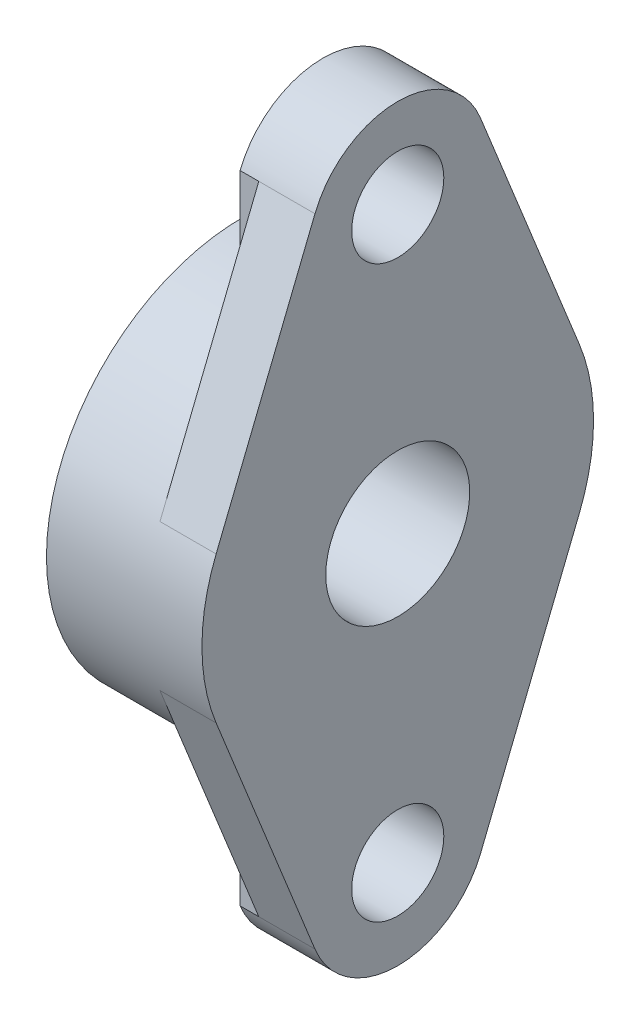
ISO-10303-21;
HEADER;
FILE_DESCRIPTION(('STEP AP214'),'2;1');
FILE_NAME('part.step','',(''),(''),'','','');
FILE_SCHEMA(('AUTOMOTIVE_DESIGN { 1 0 10303 214 1 1 1 1 }'));
ENDSEC;
DATA;
#1=APPLICATION_CONTEXT('core data for automotive mechanical design processes');
#2=APPLICATION_PROTOCOL_DEFINITION('international standard','automotive_design',2000,#1);
#3=PRODUCT_CONTEXT('',#1,'mechanical');
#4=PRODUCT('Part','Part','',(#3));
#5=PRODUCT_RELATED_PRODUCT_CATEGORY('part','',(#4));
#6=PRODUCT_DEFINITION_FORMATION('','',#4);
#7=PRODUCT_DEFINITION_CONTEXT('part definition',#1,'design');
#8=PRODUCT_DEFINITION('design','',#6,#7);
#9=PRODUCT_DEFINITION_SHAPE('','',#8);
#10=(LENGTH_UNIT() NAMED_UNIT(*) SI_UNIT(.MILLI.,.METRE.));
#11=(NAMED_UNIT(*) PLANE_ANGLE_UNIT() SI_UNIT($,.RADIAN.));
#12=(NAMED_UNIT(*) SI_UNIT($,.STERADIAN.) SOLID_ANGLE_UNIT());
#13=UNCERTAINTY_MEASURE_WITH_UNIT(LENGTH_MEASURE(1.E-05),#10,'distance_accuracy_value','');
#14=(GEOMETRIC_REPRESENTATION_CONTEXT(3) GLOBAL_UNCERTAINTY_ASSIGNED_CONTEXT((#13)) GLOBAL_UNIT_ASSIGNED_CONTEXT((#10,
#11,#12)) REPRESENTATION_CONTEXT('',''));
#15=CARTESIAN_POINT('',(0.,0.,0.));
#16=DIRECTION('',(0.,0.,1.));
#17=DIRECTION('',(1.,0.,0.));
#18=AXIS2_PLACEMENT_3D('',#15,#16,#17);
#19=CARTESIAN_POINT('',(-9.75,-55.5484247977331,-31.536175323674));
#20=DIRECTION('',(-1.,0.,0.));
#21=DIRECTION('',(0.,0.,1.));
#22=AXIS2_PLACEMENT_3D('',#19,#20,#21);
#23=PLANE('',#22);
#24=DIRECTION('',(0.,-1.,0.));
#25=VECTOR('',#24,1.);
#26=CARTESIAN_POINT('',(-9.75,-43.0518860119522,-14.376785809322));
#27=LINE('',#26,#25);
#28=CARTESIAN_POINT('',(-9.75,-30.810842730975,-14.376785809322));
#29=VERTEX_POINT('',#28);
#30=CARTESIAN_POINT('',(-9.75,-55.2929292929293,-14.376785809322));
#31=VERTEX_POINT('',#30);
#32=EDGE_CURVE('E71',#29,#31,#27,.T.);
#33=ORIENTED_EDGE('',*,*,#32,.F.);
#34=CARTESIAN_POINT('',(-9.75,0.,0.));
#35=DIRECTION('',(-1.,0.,0.));
#36=DIRECTION('',(0.,0.,1.));
#37=AXIS2_PLACEMENT_3D('',#34,#35,#36);
#38=CIRCLE('',#37,34.);
#39=CARTESIAN_POINT('',(-9.75,-12.7103451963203,-31.534855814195));
#40=VERTEX_POINT('',#39);
#41=EDGE_CURVE('E208',#40,#29,#38,.T.);
#42=ORIENTED_EDGE('',*,*,#41,.F.);
#43=DIRECTION('',(0.,0.927534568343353,-0.373737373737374));
#44=VECTOR('',#43,1.);
#45=CARTESIAN_POINT('',(-9.75,-34.,-22.956480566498));
#46=LINE('',#45,#44);
#47=EDGE_CURVE('E308',#31,#40,#46,.T.);
#48=ORIENTED_EDGE('',*,*,#47,.F.);
#49=EDGE_LOOP('',(#33,#42,#48));
#50=FACE_BOUND('',#49,.T.);
#51=ADVANCED_FACE('F16',(#50),#23,.T.);
#52=CARTESIAN_POINT('',(-13.,-55.2929292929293,-14.376785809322));
#53=DIRECTION('',(0.,0.,-1.));
#54=DIRECTION('',(0.,1.,0.));
#55=AXIS2_PLACEMENT_3D('',#52,#53,#54);
#56=PLANE('',#55);
#57=DIRECTION('',(0.,-1.,0.));
#58=VECTOR('',#57,1.);
#59=CARTESIAN_POINT('',(-13.,-48.0763671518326,-14.376785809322));
#60=LINE('',#59,#58);
#61=CARTESIAN_POINT('',(-13.,-30.8108427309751,-14.376785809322));
#62=VERTEX_POINT('',#61);
#63=CARTESIAN_POINT('',(-13.,-55.2929292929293,-14.376785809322));
#64=VERTEX_POINT('',#63);
#65=EDGE_CURVE('E65',#62,#64,#60,.T.);
#66=ORIENTED_EDGE('',*,*,#65,.F.);
#67=DIRECTION('',(-1.,0.,0.));
#68=VECTOR('',#67,1.);
#69=CARTESIAN_POINT('',(-13.5,-30.810842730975,-14.376785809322));
#70=LINE('',#69,#68);
#71=EDGE_CURVE('E300',#29,#62,#70,.T.);
#72=ORIENTED_EDGE('',*,*,#71,.F.);
#73=ORIENTED_EDGE('',*,*,#32,.T.);
#74=DIRECTION('',(1.,0.,0.));
#75=VECTOR('',#74,1.);
#76=CARTESIAN_POINT('',(-6.5,-55.2929292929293,-14.376785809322));
#77=LINE('',#76,#75);
#78=EDGE_CURVE('E316',#64,#31,#77,.T.);
#79=ORIENTED_EDGE('',*,*,#78,.F.);
#80=EDGE_LOOP('',(#66,#72,#73,#79));
#81=FACE_BOUND('',#80,.T.);
#82=ADVANCED_FACE('F482',(#81),#56,.T.);
#83=CARTESIAN_POINT('',(-9.75,12.454849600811,-31.536175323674));
#84=DIRECTION('',(-1.,0.,0.));
#85=DIRECTION('',(0.,0.,1.));
#86=AXIS2_PLACEMENT_3D('',#83,#84,#85);
#87=PLANE('',#86);
#88=CARTESIAN_POINT('',(-9.75,0.,0.));
#89=DIRECTION('',(-1.,0.,0.));
#90=DIRECTION('',(0.,0.,1.));
#91=AXIS2_PLACEMENT_3D('',#88,#89,#90);
#92=CIRCLE('',#91,34.);
#93=CARTESIAN_POINT('',(-9.75,30.8108427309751,-14.376785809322));
#94=VERTEX_POINT('',#93);
#95=CARTESIAN_POINT('',(-9.75,12.7103451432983,-31.5348558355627));
#96=VERTEX_POINT('',#95);
#97=EDGE_CURVE('E360',#94,#96,#92,.T.);
#98=ORIENTED_EDGE('',*,*,#97,.F.);
#99=DIRECTION('',(0.,-1.,0.));
#100=VECTOR('',#99,1.);
#101=CARTESIAN_POINT('',(-9.75,43.0518860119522,-14.376785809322));
#102=LINE('',#101,#100);
#103=CARTESIAN_POINT('',(-9.75,55.2929292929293,-14.376785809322));
#104=VERTEX_POINT('',#103);
#105=EDGE_CURVE('E270',#104,#94,#102,.T.);
#106=ORIENTED_EDGE('',*,*,#105,.F.);
#107=DIRECTION('',(0.,0.927534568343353,0.373737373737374));
#108=VECTOR('',#107,1.);
#109=CARTESIAN_POINT('',(-9.75,34.,-22.956480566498));
#110=LINE('',#109,#108);
#111=EDGE_CURVE('E203',#96,#104,#110,.T.);
#112=ORIENTED_EDGE('',*,*,#111,.F.);
#113=EDGE_LOOP('',(#98,#106,#112));
#114=FACE_BOUND('',#113,.T.);
#115=ADVANCED_FACE('F371',(#114),#87,.T.);
#116=CARTESIAN_POINT('',(-13.,30.810842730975,-14.376785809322));
#117=DIRECTION('',(0.,0.,-1.));
#118=DIRECTION('',(0.,1.,0.));
#119=AXIS2_PLACEMENT_3D('',#116,#117,#118);
#120=PLANE('',#119);
#121=DIRECTION('',(0.,-1.,0.));
#122=VECTOR('',#121,1.);
#123=CARTESIAN_POINT('',(-13.,48.0763671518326,-14.376785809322));
#124=LINE('',#123,#122);
#125=CARTESIAN_POINT('',(-13.,55.2929292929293,-14.376785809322));
#126=VERTEX_POINT('',#125);
#127=CARTESIAN_POINT('',(-13.,30.8108427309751,-14.376785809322));
#128=VERTEX_POINT('',#127);
#129=EDGE_CURVE('E245',#126,#128,#124,.T.);
#130=ORIENTED_EDGE('',*,*,#129,.F.);
#131=DIRECTION('',(-1.,0.,0.));
#132=VECTOR('',#131,1.);
#133=CARTESIAN_POINT('',(-6.5,55.2929292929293,-14.376785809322));
#134=LINE('',#133,#132);
#135=EDGE_CURVE('E197',#104,#126,#134,.T.);
#136=ORIENTED_EDGE('',*,*,#135,.F.);
#137=ORIENTED_EDGE('',*,*,#105,.T.);
#138=DIRECTION('',(1.,0.,0.));
#139=VECTOR('',#138,1.);
#140=CARTESIAN_POINT('',(-13.5,30.8108427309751,-14.376785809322));
#141=LINE('',#140,#139);
#142=EDGE_CURVE('E215',#128,#94,#141,.T.);
#143=ORIENTED_EDGE('',*,*,#142,.F.);
#144=EDGE_LOOP('',(#130,#136,#137,#143));
#145=FACE_BOUND('',#144,.T.);
#146=ADVANCED_FACE('F366',(#145),#120,.T.);
#147=CARTESIAN_POINT('',(-13.,-30.810842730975,14.376785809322));
#148=DIRECTION('',(0.,0.,1.));
#149=DIRECTION('',(0.,-1.,0.));
#150=AXIS2_PLACEMENT_3D('',#147,#148,#149);
#151=PLANE('',#150);
#152=DIRECTION('',(0.,1.,0.));
#153=VECTOR('',#152,1.);
#154=CARTESIAN_POINT('',(-13.,-48.0763671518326,14.376785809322));
#155=LINE('',#154,#153);
#156=CARTESIAN_POINT('',(-13.,-55.2929292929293,14.376785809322));
#157=VERTEX_POINT('',#156);
#158=CARTESIAN_POINT('',(-13.,-30.8108427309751,14.376785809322));
#159=VERTEX_POINT('',#158);
#160=EDGE_CURVE('E59',#157,#159,#155,.T.);
#161=ORIENTED_EDGE('',*,*,#160,.F.);
#162=DIRECTION('',(-1.,0.,0.));
#163=VECTOR('',#162,1.);
#164=CARTESIAN_POINT('',(-6.5,-55.2929292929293,14.376785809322));
#165=LINE('',#164,#163);
#166=CARTESIAN_POINT('',(-9.75,-55.2929292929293,14.376785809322));
#167=VERTEX_POINT('',#166);
#168=EDGE_CURVE('E257',#167,#157,#165,.T.);
#169=ORIENTED_EDGE('',*,*,#168,.F.);
#170=DIRECTION('',(0.,1.,0.));
#171=VECTOR('',#170,1.);
#172=CARTESIAN_POINT('',(-9.75,-55.2929292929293,14.376785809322));
#173=LINE('',#172,#171);
#174=CARTESIAN_POINT('',(-9.75,-30.8108427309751,14.376785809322));
#175=VERTEX_POINT('',#174);
#176=EDGE_CURVE('E251',#175,#167,#173,.F.);
#177=ORIENTED_EDGE('',*,*,#176,.F.);
#178=DIRECTION('',(1.,0.,0.));
#179=VECTOR('',#178,1.);
#180=CARTESIAN_POINT('',(-13.5,-30.8108427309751,14.376785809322));
#181=LINE('',#180,#179);
#182=EDGE_CURVE('E277',#159,#175,#181,.T.);
#183=ORIENTED_EDGE('',*,*,#182,.F.);
#184=EDGE_LOOP('',(#161,#169,#177,#183));
#185=FACE_BOUND('',#184,.T.);
#186=ADVANCED_FACE('F432',(#185),#151,.T.);
#187=CARTESIAN_POINT('',(-9.75,12.45484965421,14.376785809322));
#188=DIRECTION('',(-1.,0.,0.));
#189=DIRECTION('',(0.,0.,1.));
#190=AXIS2_PLACEMENT_3D('',#187,#188,#189);
#191=PLANE('',#190);
#192=DIRECTION('',(0.,1.,0.));
#193=VECTOR('',#192,1.);
#194=CARTESIAN_POINT('',(-9.75,43.0518860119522,14.376785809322));
#195=LINE('',#194,#193);
#196=CARTESIAN_POINT('',(-9.75,30.8108427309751,14.376785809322));
#197=VERTEX_POINT('',#196);
#198=CARTESIAN_POINT('',(-9.75,55.2929292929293,14.376785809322));
#199=VERTEX_POINT('',#198);
#200=EDGE_CURVE('E133',#197,#199,#195,.T.);
#201=ORIENTED_EDGE('',*,*,#200,.F.);
#202=CARTESIAN_POINT('',(-9.75,0.,0.));
#203=DIRECTION('',(-1.,0.,0.));
#204=DIRECTION('',(0.,0.,1.));
#205=AXIS2_PLACEMENT_3D('',#202,#203,#204);
#206=CIRCLE('',#205,34.);
#207=CARTESIAN_POINT('',(-9.75,12.710345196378,31.5348558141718));
#208=VERTEX_POINT('',#207);
#209=EDGE_CURVE('E184',#208,#197,#206,.T.);
#210=ORIENTED_EDGE('',*,*,#209,.F.);
#211=DIRECTION('',(0.,-0.927534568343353,0.373737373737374));
#212=VECTOR('',#211,1.);
#213=CARTESIAN_POINT('',(-9.75,34.,22.956480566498));
#214=LINE('',#213,#212);
#215=EDGE_CURVE('E274',#199,#208,#214,.T.);
#216=ORIENTED_EDGE('',*,*,#215,.F.);
#217=EDGE_LOOP('',(#201,#210,#216));
#218=FACE_BOUND('',#217,.T.);
#219=ADVANCED_FACE('F420',(#218),#191,.T.);
#220=CARTESIAN_POINT('',(-13.,55.2929292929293,14.376785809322));
#221=DIRECTION('',(0.,0.,1.));
#222=DIRECTION('',(0.,-1.,0.));
#223=AXIS2_PLACEMENT_3D('',#220,#221,#222);
#224=PLANE('',#223);
#225=DIRECTION('',(0.,1.,0.));
#226=VECTOR('',#225,1.);
#227=CARTESIAN_POINT('',(-13.,48.0763671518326,14.376785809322));
#228=LINE('',#227,#226);
#229=CARTESIAN_POINT('',(-13.,30.8108427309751,14.376785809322));
#230=VERTEX_POINT('',#229);
#231=CARTESIAN_POINT('',(-13.,55.2929292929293,14.376785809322));
#232=VERTEX_POINT('',#231);
#233=EDGE_CURVE('E128',#230,#232,#228,.T.);
#234=ORIENTED_EDGE('',*,*,#233,.F.);
#235=DIRECTION('',(-1.,0.,0.));
#236=VECTOR('',#235,1.);
#237=CARTESIAN_POINT('',(-13.5,30.8108427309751,14.376785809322));
#238=LINE('',#237,#236);
#239=EDGE_CURVE('E267',#197,#230,#238,.T.);
#240=ORIENTED_EDGE('',*,*,#239,.F.);
#241=ORIENTED_EDGE('',*,*,#200,.T.);
#242=DIRECTION('',(1.,0.,0.));
#243=VECTOR('',#242,1.);
#244=CARTESIAN_POINT('',(-6.5,55.2929292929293,14.376785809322));
#245=LINE('',#244,#243);
#246=EDGE_CURVE('E284',#232,#199,#245,.T.);
#247=ORIENTED_EDGE('',*,*,#246,.F.);
#248=EDGE_LOOP('',(#234,#240,#241,#247));
#249=FACE_BOUND('',#248,.T.);
#250=ADVANCED_FACE('F424',(#249),#224,.T.);
#251=CARTESIAN_POINT('',(-9.75,-55.5484247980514,14.376785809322));
#252=DIRECTION('',(-1.,0.,0.));
#253=DIRECTION('',(0.,0.,1.));
#254=AXIS2_PLACEMENT_3D('',#251,#252,#253);
#255=PLANE('',#254);
#256=CARTESIAN_POINT('',(-9.75,0.,0.));
#257=DIRECTION('',(-1.,0.,0.));
#258=DIRECTION('',(0.,0.,1.));
#259=AXIS2_PLACEMENT_3D('',#256,#257,#258);
#260=CIRCLE('',#259,34.);
#261=CARTESIAN_POINT('',(-9.75,-12.7103451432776,31.5348558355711));
#262=VERTEX_POINT('',#261);
#263=EDGE_CURVE('E154',#175,#262,#260,.T.);
#264=ORIENTED_EDGE('',*,*,#263,.F.);
#265=ORIENTED_EDGE('',*,*,#176,.T.);
#266=DIRECTION('',(0.,-0.927534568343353,-0.373737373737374));
#267=VECTOR('',#266,1.);
#268=CARTESIAN_POINT('',(-9.75,-34.,22.956480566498));
#269=LINE('',#268,#267);
#270=EDGE_CURVE('E171',#262,#167,#269,.T.);
#271=ORIENTED_EDGE('',*,*,#270,.F.);
#272=EDGE_LOOP('',(#264,#265,#271));
#273=FACE_BOUND('',#272,.T.);
#274=ADVANCED_FACE('F238',(#273),#255,.T.);
#275=CARTESIAN_POINT('',(-13.,30.810842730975,14.376785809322));
#276=CARTESIAN_POINT('',(-13.,65.,14.376785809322));
#277=CARTESIAN_POINT('',(-13.,65.3418915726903,14.376785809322));
#278=B_SPLINE_CURVE_WITH_KNOTS('',1,(#275,#276,#277),.UNSPECIFIED.,.F.,.F.,(2,1,2),(0.,1.,1.01),.UNSPECIFIED.);
#279=DIRECTION('',(0.,0.,-1.));
#280=VECTOR('',#279,1.);
#281=SURFACE_OF_LINEAR_EXTRUSION('',#278,#280);
#282=CARTESIAN_POINT('',(-13.,49.5,0.));
#283=DIRECTION('',(1.,0.,0.));
#284=DIRECTION('',(0.,0.,-1.));
#285=AXIS2_PLACEMENT_3D('',#282,#283,#284);
#286=CIRCLE('',#285,8.);
#287=CARTESIAN_POINT('',(-13.,49.5,-8.));
#288=VERTEX_POINT('',#287);
#289=EDGE_CURVE('E165',#288,#288,#286,.F.);
#290=ORIENTED_EDGE('',*,*,#289,.F.);
#291=EDGE_LOOP('',(#290));
#292=FACE_BOUND('',#291,.T.);
#293=ORIENTED_EDGE('',*,*,#129,.T.);
#294=CARTESIAN_POINT('',(-13.,0.,0.));
#295=DIRECTION('',(-1.,0.,0.));
#296=DIRECTION('',(0.,0.,1.));
#297=AXIS2_PLACEMENT_3D('',#294,#295,#296);
#298=CIRCLE('',#297,34.);
#299=EDGE_CURVE('E261',#230,#128,#298,.T.);
#300=ORIENTED_EDGE('',*,*,#299,.F.);
#301=ORIENTED_EDGE('',*,*,#233,.T.);
#302=CARTESIAN_POINT('',(-13.,49.5,0.));
#303=DIRECTION('',(1.,0.,0.));
#304=DIRECTION('',(0.,0.,-1.));
#305=AXIS2_PLACEMENT_3D('',#302,#303,#304);
#306=CIRCLE('',#305,15.5);
#307=EDGE_CURVE('E288',#126,#232,#306,.T.);
#308=ORIENTED_EDGE('',*,*,#307,.F.);
#309=EDGE_LOOP('',(#293,#300,#301,#308));
#310=FACE_BOUND('',#309,.T.);
#311=ADVANCED_FACE('F232',(#292,#310),#281,.T.);
#312=CARTESIAN_POINT('',(-13.,-65.3418915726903,14.376785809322));
#313=CARTESIAN_POINT('',(-13.,-65.,14.376785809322));
#314=CARTESIAN_POINT('',(-13.,-30.810842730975,14.376785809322));
#315=B_SPLINE_CURVE_WITH_KNOTS('',1,(#312,#313,#314),.UNSPECIFIED.,.F.,.F.,(2,1,2),(-0.01,0.,
1.),.UNSPECIFIED.);
#316=DIRECTION('',(0.,0.,-1.));
#317=VECTOR('',#316,1.);
#318=SURFACE_OF_LINEAR_EXTRUSION('',#315,#317);
#319=CARTESIAN_POINT('',(-13.,-49.5,0.));
#320=DIRECTION('',(1.,0.,0.));
#321=DIRECTION('',(0.,0.,-1.));
#322=AXIS2_PLACEMENT_3D('',#319,#320,#321);
#323=CIRCLE('',#322,8.);
#324=CARTESIAN_POINT('',(-13.,-49.5,-8.));
#325=VERTEX_POINT('',#324);
#326=EDGE_CURVE('E169',#325,#325,#323,.F.);
#327=ORIENTED_EDGE('',*,*,#326,.F.);
#328=EDGE_LOOP('',(#327));
#329=FACE_BOUND('',#328,.T.);
#330=ORIENTED_EDGE('',*,*,#65,.T.);
#331=CARTESIAN_POINT('',(-13.,-49.5,0.));
#332=DIRECTION('',(1.,0.,0.));
#333=DIRECTION('',(0.,0.,-1.));
#334=AXIS2_PLACEMENT_3D('',#331,#332,#333);
#335=CIRCLE('',#334,15.5);
#336=EDGE_CURVE('E19',#157,#64,#335,.T.);
#337=ORIENTED_EDGE('',*,*,#336,.F.);
#338=ORIENTED_EDGE('',*,*,#160,.T.);
#339=CARTESIAN_POINT('',(-13.,0.,0.));
#340=DIRECTION('',(-1.,0.,0.));
#341=DIRECTION('',(0.,0.,1.));
#342=AXIS2_PLACEMENT_3D('',#339,#340,#341);
#343=CIRCLE('',#342,34.);
#344=EDGE_CURVE('E353',#62,#159,#343,.T.);
#345=ORIENTED_EDGE('',*,*,#344,.F.);
#346=EDGE_LOOP('',(#330,#337,#338,#345));
#347=FACE_BOUND('',#346,.T.);
#348=ADVANCED_FACE('F227',(#329,#347),#318,.T.);
#349=CARTESIAN_POINT('',(-27.,-34.,34.4080021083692));
#350=DIRECTION('',(-1.,0.,0.));
#351=DIRECTION('',(0.,1.,0.));
#352=AXIS2_PLACEMENT_3D('',#349,#350,#351);
#353=PLANE('',#352);
#354=CARTESIAN_POINT('',(-27.,0.,0.));
#355=DIRECTION('',(-1.,0.,0.));
#356=DIRECTION('',(0.,0.,1.));
#357=AXIS2_PLACEMENT_3D('',#354,#355,#356);
#358=CIRCLE('',#357,18.75);
#359=CARTESIAN_POINT('',(-27.,0.,18.75));
#360=VERTEX_POINT('',#359);
#361=EDGE_CURVE('E344',#360,#360,#358,.T.);
#362=ORIENTED_EDGE('',*,*,#361,.F.);
#363=EDGE_LOOP('',(#362));
#364=FACE_BOUND('',#363,.T.);
#365=CARTESIAN_POINT('',(-27.,0.,0.));
#366=DIRECTION('',(-1.,0.,0.));
#367=DIRECTION('',(0.,0.,1.));
#368=AXIS2_PLACEMENT_3D('',#365,#366,#367);
#369=CIRCLE('',#368,34.);
#370=CARTESIAN_POINT('',(-27.,0.,34.));
#371=VERTEX_POINT('',#370);
#372=EDGE_CURVE('E190',#371,#371,#369,.F.);
#373=ORIENTED_EDGE('',*,*,#372,.F.);
#374=EDGE_LOOP('',(#373));
#375=FACE_BOUND('',#374,.T.);
#376=ADVANCED_FACE('F231',(#364,#375),#353,.T.);
#377=CARTESIAN_POINT('',(0.,-49.5,0.));
#378=DIRECTION('',(1.,0.,0.));
#379=DIRECTION('',(0.,0.,-1.));
#380=AXIS2_PLACEMENT_3D('',#377,#378,#379);
#381=CYLINDRICAL_SURFACE('',#380,15.5);
#382=ORIENTED_EDGE('',*,*,#336,.T.);
#383=ORIENTED_EDGE('',*,*,#78,.T.);
#384=DIRECTION('',(1.,0.,0.));
#385=VECTOR('',#384,1.);
#386=CARTESIAN_POINT('',(-9.75,-55.2929292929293,-14.376785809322));
#387=LINE('',#386,#385);
#388=CARTESIAN_POINT('',(0.,-55.2929292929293,-14.376785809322));
#389=VERTEX_POINT('',#388);
#390=EDGE_CURVE('E212',#389,#31,#387,.F.);
#391=ORIENTED_EDGE('',*,*,#390,.F.);
#392=CARTESIAN_POINT('',(0.,-49.5,0.));
#393=DIRECTION('',(1.,0.,0.));
#394=DIRECTION('',(0.,0.,-1.));
#395=AXIS2_PLACEMENT_3D('',#392,#393,#394);
#396=CIRCLE('',#395,15.5);
#397=CARTESIAN_POINT('',(0.,-55.2929292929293,14.376785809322));
#398=VERTEX_POINT('',#397);
#399=EDGE_CURVE('E341',#398,#389,#396,.T.);
#400=ORIENTED_EDGE('',*,*,#399,.F.);
#401=DIRECTION('',(1.,0.,0.));
#402=VECTOR('',#401,1.);
#403=CARTESIAN_POINT('',(-9.75,-55.2929292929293,14.376785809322));
#404=LINE('',#403,#402);
#405=EDGE_CURVE('E166',#167,#398,#404,.T.);
#406=ORIENTED_EDGE('',*,*,#405,.F.);
#407=ORIENTED_EDGE('',*,*,#168,.T.);
#408=EDGE_LOOP('',(#382,#383,#391,#400,#406,#407));
#409=FACE_BOUND('',#408,.T.);
#410=ADVANCED_FACE('F454',(#409),#381,.T.);
#411=CARTESIAN_POINT('',(-9.75,-55.2929292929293,-14.376785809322));
#412=DIRECTION('',(0.,-0.373737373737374,-0.927534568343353));
#413=DIRECTION('',(0.,0.927534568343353,-0.373737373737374));
#414=AXIS2_PLACEMENT_3D('',#411,#412,#413);
#415=PLANE('',#414);
#416=CARTESIAN_POINT('',(0.,-55.2929292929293,-14.376785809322));
#417=CARTESIAN_POINT('',(0.,-53.5185185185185,-15.09176037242));
#418=CARTESIAN_POINT('',(0.,-51.7441077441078,-15.806734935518));
#419=CARTESIAN_POINT('',(0.,-48.1952861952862,-17.236684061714));
#420=CARTESIAN_POINT('',(0.,-46.4208754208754,-17.951658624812));
#421=CARTESIAN_POINT('',(0.,-42.8720538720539,-19.381607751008));
#422=CARTESIAN_POINT('',(0.,-41.0976430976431,-20.096582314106));
#423=CARTESIAN_POINT('',(0.,-37.5488215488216,-21.526531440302));
#424=CARTESIAN_POINT('',(0.,-35.7744107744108,-22.2415060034));
#425=CARTESIAN_POINT('',(0.,-32.2255892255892,-23.671455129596));
#426=CARTESIAN_POINT('',(0.,-30.4511784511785,-24.386429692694));
#427=CARTESIAN_POINT('',(0.,-26.9023569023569,-25.81637881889));
#428=CARTESIAN_POINT('',(0.,-25.1279461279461,-26.531353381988));
#429=CARTESIAN_POINT('',(0.,-21.5791245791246,-27.961302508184));
#430=CARTESIAN_POINT('',(0.,-19.8047138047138,-28.676277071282));
#431=CARTESIAN_POINT('',(0.,-16.2558922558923,-30.106226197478));
#432=CARTESIAN_POINT('',(0.,-14.4814814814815,-30.821200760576));
#433=CARTESIAN_POINT('',(0.,-12.7070707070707,-31.536175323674));
#434=B_SPLINE_CURVE_WITH_KNOTS('',3,(#416,#417,#418,#419,#420,#421,#422,#423,#424,#425,#426,
#427,#428,#429,#430,#431,#432,#433),.UNSPECIFIED.,.F.,.F.,(4,2,2,2,2,2,2,2,4),(0.,
5.7391201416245,11.478240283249,17.2173604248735,22.956480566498,28.6956007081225,
34.434720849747,40.1738409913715,45.912961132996),.UNSPECIFIED.);
#435=CARTESIAN_POINT('',(0.,-12.7070707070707,-31.536175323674));
#436=VERTEX_POINT('',#435);
#437=EDGE_CURVE('E340',#389,#436,#434,.T.);
#438=ORIENTED_EDGE('',*,*,#437,.F.);
#439=ORIENTED_EDGE('',*,*,#390,.T.);
#440=ORIENTED_EDGE('',*,*,#47,.T.);
#441=CARTESIAN_POINT('',(-9.75,-12.7070707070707,-31.536175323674));
#442=VERTEX_POINT('',#441);
#443=EDGE_CURVE('E34',#40,#442,#46,.T.);
#444=ORIENTED_EDGE('',*,*,#443,.T.);
#445=DIRECTION('',(-1.,0.,0.));
#446=VECTOR('',#445,1.);
#447=CARTESIAN_POINT('',(-13.5,-12.7070707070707,-31.536175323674));
#448=LINE('',#447,#446);
#449=EDGE_CURVE('E206',#436,#442,#448,.T.);
#450=ORIENTED_EDGE('',*,*,#449,.F.);
#451=EDGE_LOOP('',(#438,#439,#440,#444,#450));
#452=FACE_BOUND('',#451,.T.);
#453=ADVANCED_FACE('F472',(#452),#415,.T.);
#454=CARTESIAN_POINT('',(-9.75,12.7070707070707,-31.536175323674));
#455=DIRECTION('',(0.,0.373737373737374,-0.927534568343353));
#456=DIRECTION('',(0.,0.927534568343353,0.373737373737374));
#457=AXIS2_PLACEMENT_3D('',#454,#455,#456);
#458=PLANE('',#457);
#459=CARTESIAN_POINT('',(0.,12.7070707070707,-31.536175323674));
#460=CARTESIAN_POINT('',(0.,14.4814814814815,-30.821200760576));
#461=CARTESIAN_POINT('',(0.,16.2558922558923,-30.106226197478));
#462=CARTESIAN_POINT('',(0.,19.8047138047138,-28.676277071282));
#463=CARTESIAN_POINT('',(0.,21.5791245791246,-27.961302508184));
#464=CARTESIAN_POINT('',(0.,25.1279461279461,-26.531353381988));
#465=CARTESIAN_POINT('',(0.,26.9023569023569,-25.81637881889));
#466=CARTESIAN_POINT('',(0.,30.4511784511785,-24.386429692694));
#467=CARTESIAN_POINT('',(0.,32.2255892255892,-23.671455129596));
#468=CARTESIAN_POINT('',(0.,35.7744107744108,-22.2415060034));
#469=CARTESIAN_POINT('',(0.,37.5488215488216,-21.526531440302));
#470=CARTESIAN_POINT('',(0.,41.0976430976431,-20.096582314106));
#471=CARTESIAN_POINT('',(0.,42.8720538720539,-19.381607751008));
#472=CARTESIAN_POINT('',(0.,46.4208754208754,-17.951658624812));
#473=CARTESIAN_POINT('',(0.,48.1952861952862,-17.236684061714));
#474=CARTESIAN_POINT('',(0.,51.7441077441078,-15.806734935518));
#475=CARTESIAN_POINT('',(0.,53.5185185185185,-15.09176037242));
#476=CARTESIAN_POINT('',(0.,55.2929292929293,-14.376785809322));
#477=B_SPLINE_CURVE_WITH_KNOTS('',3,(#459,#460,#461,#462,#463,#464,#465,#466,#467,#468,#469,
#470,#471,#472,#473,#474,#475,#476),.UNSPECIFIED.,.F.,.F.,(4,2,2,2,2,2,2,2,4),(0.,
5.7391201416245,11.478240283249,17.2173604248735,22.956480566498,28.6956007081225,
34.434720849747,40.1738409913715,45.912961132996),.UNSPECIFIED.);
#478=CARTESIAN_POINT('',(0.,12.7070707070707,-31.536175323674));
#479=VERTEX_POINT('',#478);
#480=CARTESIAN_POINT('',(0.,55.2929292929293,-14.376785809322));
#481=VERTEX_POINT('',#480);
#482=EDGE_CURVE('E336',#479,#481,#477,.T.);
#483=ORIENTED_EDGE('',*,*,#482,.F.);
#484=DIRECTION('',(1.,0.,0.));
#485=VECTOR('',#484,1.);
#486=CARTESIAN_POINT('',(-9.75,12.7070707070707,-31.536175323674));
#487=LINE('',#486,#485);
#488=CARTESIAN_POINT('',(-9.75,12.7070707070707,-31.536175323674));
#489=VERTEX_POINT('',#488);
#490=EDGE_CURVE('E198',#479,#489,#487,.F.);
#491=ORIENTED_EDGE('',*,*,#490,.T.);
#492=CARTESIAN_POINT('',(-9.75,0.,0.));
#493=DIRECTION('',(-1.,0.,0.));
#494=DIRECTION('',(0.,1.,0.));
#495=AXIS2_PLACEMENT_3D('',#492,#493,#494);
#496=CIRCLE('',#495,34.);
#497=EDGE_CURVE('E209',#96,#489,#496,.T.);
#498=ORIENTED_EDGE('',*,*,#497,.F.);
#499=ORIENTED_EDGE('',*,*,#111,.T.);
#500=DIRECTION('',(-1.,0.,0.));
#501=VECTOR('',#500,1.);
#502=CARTESIAN_POINT('',(-6.5,55.2929292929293,-14.376785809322));
#503=LINE('',#502,#501);
#504=EDGE_CURVE('E194',#481,#104,#503,.T.);
#505=ORIENTED_EDGE('',*,*,#504,.F.);
#506=EDGE_LOOP('',(#483,#491,#498,#499,#505));
#507=FACE_BOUND('',#506,.T.);
#508=ADVANCED_FACE('F374',(#507),#458,.T.);
#509=CARTESIAN_POINT('',(0.,49.5,0.));
#510=DIRECTION('',(1.,0.,0.));
#511=DIRECTION('',(0.,0.,-1.));
#512=AXIS2_PLACEMENT_3D('',#509,#510,#511);
#513=CYLINDRICAL_SURFACE('',#512,15.5);
#514=ORIENTED_EDGE('',*,*,#307,.T.);
#515=ORIENTED_EDGE('',*,*,#246,.T.);
#516=DIRECTION('',(1.,0.,0.));
#517=VECTOR('',#516,1.);
#518=CARTESIAN_POINT('',(-9.75,55.2929292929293,14.376785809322));
#519=LINE('',#518,#517);
#520=CARTESIAN_POINT('',(0.,55.2929292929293,14.376785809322));
#521=VERTEX_POINT('',#520);
#522=EDGE_CURVE('E187',#521,#199,#519,.F.);
#523=ORIENTED_EDGE('',*,*,#522,.F.);
#524=CARTESIAN_POINT('',(0.,49.5,0.));
#525=DIRECTION('',(1.,0.,0.));
#526=DIRECTION('',(0.,0.,-1.));
#527=AXIS2_PLACEMENT_3D('',#524,#525,#526);
#528=CIRCLE('',#527,15.5);
#529=EDGE_CURVE('E333',#481,#521,#528,.T.);
#530=ORIENTED_EDGE('',*,*,#529,.F.);
#531=ORIENTED_EDGE('',*,*,#504,.T.);
#532=ORIENTED_EDGE('',*,*,#135,.T.);
#533=EDGE_LOOP('',(#514,#515,#523,#530,#531,#532));
#534=FACE_BOUND('',#533,.T.);
#535=ADVANCED_FACE('F423',(#534),#513,.T.);
#536=CARTESIAN_POINT('',(-9.75,55.2929292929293,14.376785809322));
#537=DIRECTION('',(0.,0.373737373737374,0.927534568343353));
#538=DIRECTION('',(0.,-0.927534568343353,0.373737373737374));
#539=AXIS2_PLACEMENT_3D('',#536,#537,#538);
#540=PLANE('',#539);
#541=CARTESIAN_POINT('',(0.,55.2929292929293,14.376785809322));
#542=CARTESIAN_POINT('',(0.,53.5185185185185,15.09176037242));
#543=CARTESIAN_POINT('',(0.,51.7441077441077,15.806734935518));
#544=CARTESIAN_POINT('',(0.,48.1952861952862,17.236684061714));
#545=CARTESIAN_POINT('',(0.,46.4208754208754,17.951658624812));
#546=CARTESIAN_POINT('',(0.,42.8720538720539,19.381607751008));
#547=CARTESIAN_POINT('',(0.,41.0976430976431,20.096582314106));
#548=CARTESIAN_POINT('',(0.,37.5488215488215,21.526531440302));
#549=CARTESIAN_POINT('',(0.,35.7744107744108,22.2415060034));
#550=CARTESIAN_POINT('',(0.,32.2255892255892,23.671455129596));
#551=CARTESIAN_POINT('',(0.,30.4511784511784,24.386429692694));
#552=CARTESIAN_POINT('',(0.,26.9023569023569,25.81637881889));
#553=CARTESIAN_POINT('',(0.,25.1279461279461,26.531353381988));
#554=CARTESIAN_POINT('',(0.,21.5791245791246,27.961302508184));
#555=CARTESIAN_POINT('',(0.,19.8047138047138,28.676277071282));
#556=CARTESIAN_POINT('',(0.,16.2558922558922,30.106226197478));
#557=CARTESIAN_POINT('',(0.,14.4814814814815,30.821200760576));
#558=CARTESIAN_POINT('',(0.,12.7070707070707,31.536175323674));
#559=B_SPLINE_CURVE_WITH_KNOTS('',3,(#541,#542,#543,#544,#545,#546,#547,#548,#549,#550,#551,
#552,#553,#554,#555,#556,#557,#558),.UNSPECIFIED.,.F.,.F.,(4,2,2,2,2,2,2,2,4),(0.,
5.73912014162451,11.478240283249,17.2173604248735,22.956480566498,28.6956007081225,
34.434720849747,40.1738409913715,45.912961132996),.UNSPECIFIED.);
#560=CARTESIAN_POINT('',(0.,12.7070707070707,31.536175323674));
#561=VERTEX_POINT('',#560);
#562=EDGE_CURVE('E332',#521,#561,#559,.T.);
#563=ORIENTED_EDGE('',*,*,#562,.F.);
#564=ORIENTED_EDGE('',*,*,#522,.T.);
#565=ORIENTED_EDGE('',*,*,#215,.T.);
#566=CARTESIAN_POINT('',(-9.75,12.7070707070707,31.536175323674));
#567=VERTEX_POINT('',#566);
#568=EDGE_CURVE('E191',#208,#567,#214,.T.);
#569=ORIENTED_EDGE('',*,*,#568,.T.);
#570=DIRECTION('',(-1.,0.,0.));
#571=VECTOR('',#570,1.);
#572=CARTESIAN_POINT('',(-13.5,12.7070707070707,31.536175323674));
#573=LINE('',#572,#571);
#574=EDGE_CURVE('E158',#561,#567,#573,.T.);
#575=ORIENTED_EDGE('',*,*,#574,.F.);
#576=EDGE_LOOP('',(#563,#564,#565,#569,#575));
#577=FACE_BOUND('',#576,.T.);
#578=ADVANCED_FACE('F417',(#577),#540,.T.);
#579=CARTESIAN_POINT('',(-27.,0.,0.));
#580=DIRECTION('',(-1.,0.,0.));
#581=DIRECTION('',(0.,0.,1.));
#582=AXIS2_PLACEMENT_3D('',#579,#580,#581);
#583=CYLINDRICAL_SURFACE('',#582,34.);
#584=ORIENTED_EDGE('',*,*,#372,.T.);
#585=EDGE_LOOP('',(#584));
#586=FACE_BOUND('',#585,.T.);
#587=ORIENTED_EDGE('',*,*,#239,.T.);
#588=ORIENTED_EDGE('',*,*,#299,.T.);
#589=ORIENTED_EDGE('',*,*,#142,.T.);
#590=ORIENTED_EDGE('',*,*,#97,.T.);
#591=ORIENTED_EDGE('',*,*,#497,.T.);
#592=ORIENTED_EDGE('',*,*,#490,.F.);
#593=CARTESIAN_POINT('',(0.,0.,0.));
#594=DIRECTION('',(-1.,0.,0.));
#595=DIRECTION('',(0.,0.,1.));
#596=AXIS2_PLACEMENT_3D('',#593,#594,#595);
#597=CIRCLE('',#596,34.);
#598=EDGE_CURVE('E337',#436,#479,#597,.F.);
#599=ORIENTED_EDGE('',*,*,#598,.F.);
#600=ORIENTED_EDGE('',*,*,#449,.T.);
#601=ORIENTED_EDGE('',*,*,#443,.F.);
#602=ORIENTED_EDGE('',*,*,#41,.T.);
#603=ORIENTED_EDGE('',*,*,#71,.T.);
#604=ORIENTED_EDGE('',*,*,#344,.T.);
#605=ORIENTED_EDGE('',*,*,#182,.T.);
#606=ORIENTED_EDGE('',*,*,#263,.T.);
#607=CARTESIAN_POINT('',(-9.75,0.,0.));
#608=DIRECTION('',(-1.,0.,0.));
#609=DIRECTION('',(0.,1.,0.));
#610=AXIS2_PLACEMENT_3D('',#607,#608,#609);
#611=CIRCLE('',#610,34.);
#612=CARTESIAN_POINT('',(-9.75,-12.7070707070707,31.536175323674));
#613=VERTEX_POINT('',#612);
#614=EDGE_CURVE('E145',#262,#613,#611,.T.);
#615=ORIENTED_EDGE('',*,*,#614,.T.);
#616=DIRECTION('',(1.,0.,0.));
#617=VECTOR('',#616,1.);
#618=CARTESIAN_POINT('',(-9.75,-12.7070707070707,31.536175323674));
#619=LINE('',#618,#617);
#620=CARTESIAN_POINT('',(0.,-12.7070707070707,31.536175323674));
#621=VERTEX_POINT('',#620);
#622=EDGE_CURVE('E150',#621,#613,#619,.F.);
#623=ORIENTED_EDGE('',*,*,#622,.F.);
#624=CARTESIAN_POINT('',(0.,0.,0.));
#625=DIRECTION('',(-1.,0.,0.));
#626=DIRECTION('',(0.,0.,1.));
#627=AXIS2_PLACEMENT_3D('',#624,#625,#626);
#628=CIRCLE('',#627,34.);
#629=EDGE_CURVE('E330',#561,#621,#628,.F.);
#630=ORIENTED_EDGE('',*,*,#629,.F.);
#631=ORIENTED_EDGE('',*,*,#574,.T.);
#632=ORIENTED_EDGE('',*,*,#568,.F.);
#633=ORIENTED_EDGE('',*,*,#209,.T.);
#634=EDGE_LOOP('',(#587,#588,#589,#590,#591,#592,#599,#600,#601,#602,#603,#604,#605,#606,#615,
#623,#630,#631,#632,#633));
#635=FACE_BOUND('',#634,.T.);
#636=ADVANCED_FACE('F148',(#586,#635),#583,.T.);
#637=CARTESIAN_POINT('',(-9.75,-12.7070707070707,31.536175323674));
#638=DIRECTION('',(0.,-0.373737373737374,0.927534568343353));
#639=DIRECTION('',(0.,-0.927534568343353,-0.373737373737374));
#640=AXIS2_PLACEMENT_3D('',#637,#638,#639);
#641=PLANE('',#640);
#642=CARTESIAN_POINT('',(0.,-12.7070707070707,31.536175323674));
#643=CARTESIAN_POINT('',(0.,-14.4814814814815,30.821200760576));
#644=CARTESIAN_POINT('',(0.,-16.2558922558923,30.106226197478));
#645=CARTESIAN_POINT('',(0.,-19.8047138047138,28.676277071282));
#646=CARTESIAN_POINT('',(0.,-21.5791245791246,27.961302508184));
#647=CARTESIAN_POINT('',(0.,-25.1279461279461,26.531353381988));
#648=CARTESIAN_POINT('',(0.,-26.9023569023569,25.81637881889));
#649=CARTESIAN_POINT('',(0.,-30.4511784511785,24.386429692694));
#650=CARTESIAN_POINT('',(0.,-32.2255892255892,23.671455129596));
#651=CARTESIAN_POINT('',(0.,-35.7744107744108,22.2415060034));
#652=CARTESIAN_POINT('',(0.,-37.5488215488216,21.526531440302));
#653=CARTESIAN_POINT('',(0.,-41.0976430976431,20.096582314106));
#654=CARTESIAN_POINT('',(0.,-42.8720538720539,19.381607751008));
#655=CARTESIAN_POINT('',(0.,-46.4208754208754,17.951658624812));
#656=CARTESIAN_POINT('',(0.,-48.1952861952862,17.236684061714));
#657=CARTESIAN_POINT('',(0.,-51.7441077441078,15.806734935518));
#658=CARTESIAN_POINT('',(0.,-53.5185185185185,15.09176037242));
#659=CARTESIAN_POINT('',(0.,-55.2929292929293,14.376785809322));
#660=B_SPLINE_CURVE_WITH_KNOTS('',3,(#642,#643,#644,#645,#646,#647,#648,#649,#650,#651,#652,
#653,#654,#655,#656,#657,#658,#659),.UNSPECIFIED.,.F.,.F.,(4,2,2,2,2,2,2,2,4),(0.,
5.7391201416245,11.478240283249,17.2173604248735,22.956480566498,28.6956007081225,
34.434720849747,40.1738409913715,45.912961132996),.UNSPECIFIED.);
#661=EDGE_CURVE('E163',#621,#398,#660,.T.);
#662=ORIENTED_EDGE('',*,*,#661,.F.);
#663=ORIENTED_EDGE('',*,*,#622,.T.);
#664=ORIENTED_EDGE('',*,*,#614,.F.);
#665=ORIENTED_EDGE('',*,*,#270,.T.);
#666=ORIENTED_EDGE('',*,*,#405,.T.);
#667=EDGE_LOOP('',(#662,#663,#664,#665,#666));
#668=FACE_BOUND('',#667,.T.);
#669=ADVANCED_FACE('F160',(#668),#641,.T.);
#670=CARTESIAN_POINT('',(-13.,49.5,0.));
#671=DIRECTION('',(1.,0.,0.));
#672=DIRECTION('',(0.,0.,-1.));
#673=AXIS2_PLACEMENT_3D('',#670,#671,#672);
#674=CYLINDRICAL_SURFACE('',#673,8.);
#675=CARTESIAN_POINT('',(0.,49.5,0.));
#676=DIRECTION('',(1.,0.,0.));
#677=DIRECTION('',(0.,0.,-1.));
#678=AXIS2_PLACEMENT_3D('',#675,#676,#677);
#679=CIRCLE('',#678,8.);
#680=CARTESIAN_POINT('',(0.,49.5,-8.));
#681=VERTEX_POINT('',#680);
#682=EDGE_CURVE('E327',#681,#681,#679,.F.);
#683=ORIENTED_EDGE('',*,*,#682,.F.);
#684=EDGE_LOOP('',(#683));
#685=FACE_BOUND('',#684,.T.);
#686=ORIENTED_EDGE('',*,*,#289,.T.);
#687=EDGE_LOOP('',(#686));
#688=FACE_BOUND('',#687,.T.);
#689=ADVANCED_FACE('F463',(#685,#688),#674,.F.);
#690=CARTESIAN_POINT('',(-13.,-49.5,0.));
#691=DIRECTION('',(1.,0.,0.));
#692=DIRECTION('',(0.,0.,-1.));
#693=AXIS2_PLACEMENT_3D('',#690,#691,#692);
#694=CYLINDRICAL_SURFACE('',#693,8.);
#695=CARTESIAN_POINT('',(0.,-49.5,0.));
#696=DIRECTION('',(1.,0.,0.));
#697=DIRECTION('',(0.,0.,-1.));
#698=AXIS2_PLACEMENT_3D('',#695,#696,#697);
#699=CIRCLE('',#698,8.);
#700=CARTESIAN_POINT('',(0.,-49.5,-8.));
#701=VERTEX_POINT('',#700);
#702=EDGE_CURVE('E324',#701,#701,#699,.F.);
#703=ORIENTED_EDGE('',*,*,#702,.F.);
#704=EDGE_LOOP('',(#703));
#705=FACE_BOUND('',#704,.T.);
#706=ORIENTED_EDGE('',*,*,#326,.T.);
#707=EDGE_LOOP('',(#706));
#708=FACE_BOUND('',#707,.T.);
#709=ADVANCED_FACE('F449',(#705,#708),#694,.F.);
#710=CARTESIAN_POINT('',(-35.7,0.,0.));
#711=DIRECTION('',(-1.,0.,0.));
#712=DIRECTION('',(0.,0.,1.));
#713=AXIS2_PLACEMENT_3D('',#710,#711,#712);
#714=CYLINDRICAL_SURFACE('',#713,18.75);
#715=CARTESIAN_POINT('',(-35.7,0.,0.));
#716=DIRECTION('',(-1.,0.,0.));
#717=DIRECTION('',(0.,0.,1.));
#718=AXIS2_PLACEMENT_3D('',#715,#716,#717);
#719=CIRCLE('',#718,18.75);
#720=CARTESIAN_POINT('',(-35.7,0.,18.75));
#721=VERTEX_POINT('',#720);
#722=EDGE_CURVE('E321',#721,#721,#719,.T.);
#723=ORIENTED_EDGE('',*,*,#722,.F.);
#724=EDGE_LOOP('',(#723));
#725=FACE_BOUND('',#724,.T.);
#726=ORIENTED_EDGE('',*,*,#361,.T.);
#727=EDGE_LOOP('',(#726));
#728=FACE_BOUND('',#727,.T.);
#729=ADVANCED_FACE('F401',(#725,#728),#714,.T.);
#730=CARTESIAN_POINT('',(0.,66.313,34.));
#731=CARTESIAN_POINT('',(0.,65.,34.));
#732=CARTESIAN_POINT('',(0.,-65.,34.));
#733=CARTESIAN_POINT('',(0.,-66.3,34.));
#734=B_SPLINE_CURVE_WITH_KNOTS('',1,(#730,#731,#732,#733),.UNSPECIFIED.,.F.,.F.,(2,1,1,2),
(-0.0101,0.,1.,1.01),.UNSPECIFIED.);
#735=DIRECTION('',(0.,0.,-1.));
#736=VECTOR('',#735,1.);
#737=SURFACE_OF_LINEAR_EXTRUSION('',#734,#736);
#738=CARTESIAN_POINT('',(0.,0.,0.));
#739=DIRECTION('',(-1.,0.,0.));
#740=DIRECTION('',(0.,0.,1.));
#741=AXIS2_PLACEMENT_3D('',#738,#739,#740);
#742=CIRCLE('',#741,12.5);
#743=CARTESIAN_POINT('',(0.,0.,12.5));
#744=VERTEX_POINT('',#743);
#745=EDGE_CURVE('E25',#744,#744,#742,.F.);
#746=ORIENTED_EDGE('',*,*,#745,.F.);
#747=EDGE_LOOP('',(#746));
#748=FACE_BOUND('',#747,.T.);
#749=ORIENTED_EDGE('',*,*,#702,.T.);
#750=EDGE_LOOP('',(#749));
#751=FACE_BOUND('',#750,.T.);
#752=ORIENTED_EDGE('',*,*,#682,.T.);
#753=EDGE_LOOP('',(#752));
#754=FACE_BOUND('',#753,.T.);
#755=ORIENTED_EDGE('',*,*,#629,.T.);
#756=ORIENTED_EDGE('',*,*,#661,.T.);
#757=ORIENTED_EDGE('',*,*,#399,.T.);
#758=ORIENTED_EDGE('',*,*,#437,.T.);
#759=ORIENTED_EDGE('',*,*,#598,.T.);
#760=ORIENTED_EDGE('',*,*,#482,.T.);
#761=ORIENTED_EDGE('',*,*,#529,.T.);
#762=ORIENTED_EDGE('',*,*,#562,.T.);
#763=EDGE_LOOP('',(#755,#756,#757,#758,#759,#760,#761,#762));
#764=FACE_BOUND('',#763,.T.);
#765=ADVANCED_FACE('F381',(#748,#751,#754,#764),#737,.T.);
#766=CARTESIAN_POINT('',(-35.7,-18.75,18.9750021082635));
#767=DIRECTION('',(-1.,0.,0.));
#768=DIRECTION('',(0.,1.,0.));
#769=AXIS2_PLACEMENT_3D('',#766,#767,#768);
#770=PLANE('',#769);
#771=CARTESIAN_POINT('',(-35.7,0.,0.));
#772=DIRECTION('',(-1.,0.,0.));
#773=DIRECTION('',(0.,0.,1.));
#774=AXIS2_PLACEMENT_3D('',#771,#772,#773);
#775=CIRCLE('',#774,12.5);
#776=CARTESIAN_POINT('',(-35.7,0.,12.5));
#777=VERTEX_POINT('',#776);
#778=EDGE_CURVE('E10',#777,#777,#775,.T.);
#779=ORIENTED_EDGE('',*,*,#778,.F.);
#780=EDGE_LOOP('',(#779));
#781=FACE_BOUND('',#780,.T.);
#782=ORIENTED_EDGE('',*,*,#722,.T.);
#783=EDGE_LOOP('',(#782));
#784=FACE_BOUND('',#783,.T.);
#785=ADVANCED_FACE('F400',(#781,#784),#770,.T.);
#786=CARTESIAN_POINT('',(0.,0.,0.));
#787=DIRECTION('',(-1.,0.,0.));
#788=DIRECTION('',(0.,0.,1.));
#789=AXIS2_PLACEMENT_3D('',#786,#787,#788);
#790=CYLINDRICAL_SURFACE('',#789,12.5);
#791=ORIENTED_EDGE('',*,*,#745,.T.);
#792=EDGE_LOOP('',(#791));
#793=FACE_BOUND('',#792,.T.);
#794=ORIENTED_EDGE('',*,*,#778,.T.);
#795=EDGE_LOOP('',(#794));
#796=FACE_BOUND('',#795,.T.);
#797=ADVANCED_FACE('F434',(#793,#796),#790,.F.);
#798=CLOSED_SHELL('',(#51,#82,#115,#146,#186,#219,#250,#274,#311,#348,#376,#410,#453,#508,#535,
#578,#636,#669,#689,#709,#729,#765,#785,#797));
#799=MANIFOLD_SOLID_BREP('B1',#798);
#800=ADVANCED_BREP_SHAPE_REPRESENTATION('',(#18,#799),#14);
#801=SHAPE_DEFINITION_REPRESENTATION(#9,#800);
ENDSEC;
END-ISO-10303-21;
